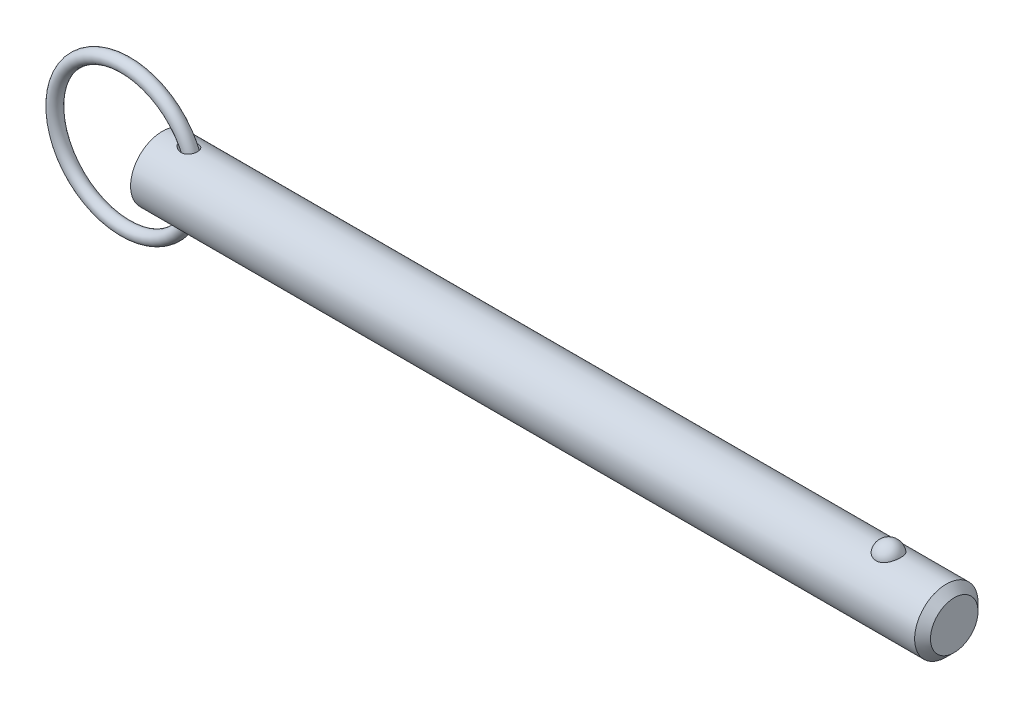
ISO-10303-21;
HEADER;
FILE_DESCRIPTION(('STEP AP214'),'2;1');
FILE_NAME('part.step','',(''),(''),'','','');
FILE_SCHEMA(('AUTOMOTIVE_DESIGN { 1 0 10303 214 1 1 1 1 }'));
ENDSEC;
DATA;
#1=APPLICATION_CONTEXT('core data for automotive mechanical design processes');
#2=APPLICATION_PROTOCOL_DEFINITION('international standard','automotive_design',2000,#1);
#3=PRODUCT_CONTEXT('',#1,'mechanical');
#4=PRODUCT('Part','Part','',(#3));
#5=PRODUCT_RELATED_PRODUCT_CATEGORY('part','',(#4));
#6=PRODUCT_DEFINITION_FORMATION('','',#4);
#7=PRODUCT_DEFINITION_CONTEXT('part definition',#1,'design');
#8=PRODUCT_DEFINITION('design','',#6,#7);
#9=PRODUCT_DEFINITION_SHAPE('','',#8);
#10=(LENGTH_UNIT() NAMED_UNIT(*) SI_UNIT(.MILLI.,.METRE.));
#11=(NAMED_UNIT(*) PLANE_ANGLE_UNIT() SI_UNIT($,.RADIAN.));
#12=(NAMED_UNIT(*) SI_UNIT($,.STERADIAN.) SOLID_ANGLE_UNIT());
#13=UNCERTAINTY_MEASURE_WITH_UNIT(LENGTH_MEASURE(1.E-05),#10,'distance_accuracy_value','');
#14=(GEOMETRIC_REPRESENTATION_CONTEXT(3) GLOBAL_UNCERTAINTY_ASSIGNED_CONTEXT((#13)) GLOBAL_UNIT_ASSIGNED_CONTEXT((#10,
#11,#12)) REPRESENTATION_CONTEXT('',''));
#15=CARTESIAN_POINT('',(0.,0.,0.));
#16=DIRECTION('',(0.,0.,1.));
#17=DIRECTION('',(1.,0.,0.));
#18=AXIS2_PLACEMENT_3D('',#15,#16,#17);
#19=CARTESIAN_POINT('',(-8.23730968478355,0.,0.));
#20=DIRECTION('',(0.,0.,1.));
#21=DIRECTION('',(1.,0.,0.));
#22=AXIS2_PLACEMENT_3D('',#19,#20,#21);
#23=TOROIDAL_SURFACE('',#22,15.875,1.422);
#24=CARTESIAN_POINT('',(9.05969031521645,0.,0.));
#25=VERTEX_POINT('',#24);
#26=VERTEX_LOOP('',#25);
#27=FACE_BOUND('',#26,.T.);
#28=ADVANCED_FACE('P0_F12',(#27),#23,.T.);
#29=CLOSED_SHELL('',(#28));
#30=MANIFOLD_SOLID_BREP('P0_B1',#29);
#31=CARTESIAN_POINT('',(0.,0.,0.));
#32=DIRECTION('',(1.,0.,0.));
#33=DIRECTION('',(0.,0.,-1.));
#34=AXIS2_PLACEMENT_3D('',#31,#32,#33);
#35=CYLINDRICAL_SURFACE('',#34,7.11);
#36=CARTESIAN_POINT('',(3.98467340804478,7.10072679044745,-0.363013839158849));
#37=CARTESIAN_POINT('',(4.00971652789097,7.09600153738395,-0.45539194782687));
#38=CARTESIAN_POINT('',(4.04401947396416,7.08958406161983,-0.545230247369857));
#39=CARTESIAN_POINT('',(4.12810160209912,7.07427055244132,-0.717157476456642));
#40=CARTESIAN_POINT('',(4.17791765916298,7.06536861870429,-0.799227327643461));
#41=CARTESIAN_POINT('',(4.28924471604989,7.04620300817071,-0.953469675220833));
#42=CARTESIAN_POINT('',(4.35063580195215,7.035953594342,-1.02573162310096));
#43=CARTESIAN_POINT('',(4.48282610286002,7.01493313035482,-1.16081412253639));
#44=CARTESIAN_POINT('',(4.55362244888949,7.00416223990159,-1.22363754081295));
#45=CARTESIAN_POINT('',(4.71659336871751,6.98090398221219,-1.35055080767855));
#46=CARTESIAN_POINT('',(4.81029272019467,6.96847103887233,-1.41269256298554));
#47=CARTESIAN_POINT('',(5.0057240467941,6.94515366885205,-1.52319699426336));
#48=CARTESIAN_POINT('',(5.10746392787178,6.93427079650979,-1.57154588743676));
#49=CARTESIAN_POINT('',(5.33503739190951,6.91346066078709,-1.66091325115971));
#50=CARTESIAN_POINT('',(5.46199550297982,6.90402388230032,-1.69921932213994));
#51=CARTESIAN_POINT('',(5.72084799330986,6.89024030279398,-1.75428261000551));
#52=CARTESIAN_POINT('',(5.85274301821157,6.88589416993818,-1.77103699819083));
#53=CARTESIAN_POINT('',(6.11557710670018,6.88337277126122,-1.78081990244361));
#54=CARTESIAN_POINT('',(6.24650031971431,6.88510489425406,-1.77420448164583));
#55=CARTESIAN_POINT('',(6.50446311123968,6.89478744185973,-1.73620392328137));
#56=CARTESIAN_POINT('',(6.6315075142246,6.90272978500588,-1.70485097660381));
#57=CARTESIAN_POINT('',(6.85933269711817,6.92243075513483,-1.62281888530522));
#58=CARTESIAN_POINT('',(6.96133251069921,6.93352131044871,-1.5753580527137));
#59=CARTESIAN_POINT('',(7.15436649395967,6.95824811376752,-1.46226310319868));
#60=CARTESIAN_POINT('',(7.24540699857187,6.97188287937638,-1.3966395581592));
#61=CARTESIAN_POINT('',(7.40446019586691,6.99838217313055,-1.25668991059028));
#62=CARTESIAN_POINT('',(7.473875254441,7.01118308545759,-1.18393777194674));
#63=CARTESIAN_POINT('',(7.59904891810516,7.03582803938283,-1.02736918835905));
#64=CARTESIAN_POINT('',(7.65481029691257,7.04767227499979,-0.943554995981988));
#65=CARTESIAN_POINT('',(7.74982438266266,7.06873077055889,-0.76979592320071));
#66=CARTESIAN_POINT('',(7.7894903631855,7.07800861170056,-0.680084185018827));
#67=CARTESIAN_POINT('',(7.85354088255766,7.09334756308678,-0.495102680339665));
#68=CARTESIAN_POINT('',(7.87792559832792,7.09940871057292,-0.399832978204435));
#69=CARTESIAN_POINT('',(7.9108898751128,7.10766731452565,-0.206294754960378));
#70=CARTESIAN_POINT('',(7.91944662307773,7.10985919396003,-0.108022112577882));
#71=CARTESIAN_POINT('',(7.920501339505,7.11012756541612,0.0886168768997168));
#72=CARTESIAN_POINT('',(7.91299895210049,7.10820396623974,0.186983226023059));
#73=CARTESIAN_POINT('',(7.88205794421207,7.10043733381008,0.381270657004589));
#74=CARTESIAN_POINT('',(7.85857985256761,7.09458459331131,0.477185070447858));
#75=CARTESIAN_POINT('',(7.79617406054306,7.07958431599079,0.663575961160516));
#76=CARTESIAN_POINT('',(7.75724672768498,7.07043685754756,0.754052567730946));
#77=CARTESIAN_POINT('',(7.66496731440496,7.04987259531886,0.926798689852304));
#78=CARTESIAN_POINT('',(7.61164530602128,7.0384605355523,1.00908483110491));
#79=CARTESIAN_POINT('',(7.49191707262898,7.01461776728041,1.16333092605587));
#80=CARTESIAN_POINT('',(7.42551210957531,7.00218715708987,1.235291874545));
#81=CARTESIAN_POINT('',(7.28164031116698,6.97770944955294,1.36680167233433));
#82=CARTESIAN_POINT('',(7.20420170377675,6.96566146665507,1.42638126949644));
#83=CARTESIAN_POINT('',(7.0403906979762,6.94319963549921,1.53199377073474));
#84=CARTESIAN_POINT('',(6.95401827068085,6.93278579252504,1.57802663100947));
#85=CARTESIAN_POINT('',(6.7731858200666,6.91444459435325,1.65656940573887));
#86=CARTESIAN_POINT('',(6.67860569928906,6.90656682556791,1.68881327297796));
#87=CARTESIAN_POINT('',(6.48544119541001,6.89422806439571,1.73849768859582));
#88=CARTESIAN_POINT('',(6.38685561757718,6.88976809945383,1.755933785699));
#89=CARTESIAN_POINT('',(6.18089829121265,6.88429907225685,1.77726234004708));
#90=CARTESIAN_POINT('',(6.07340937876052,6.88356485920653,1.78007646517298));
#91=CARTESIAN_POINT('',(5.85921220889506,6.886086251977,1.77029087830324));
#92=CARTESIAN_POINT('',(5.75250426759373,6.88934339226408,1.75768523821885));
#93=CARTESIAN_POINT('',(5.52848027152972,6.89994454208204,1.71563399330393));
#94=CARTESIAN_POINT('',(5.41155168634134,6.90775772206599,1.68424184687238));
#95=CARTESIAN_POINT('',(5.18376466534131,6.92670168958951,1.60454711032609));
#96=CARTESIAN_POINT('',(5.07291446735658,6.9378368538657,1.5562221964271));
#97=CARTESIAN_POINT('',(4.84835244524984,6.96347168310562,1.43744827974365));
#98=CARTESIAN_POINT('',(4.73562531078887,6.97820486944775,1.36517310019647));
#99=CARTESIAN_POINT('',(4.52504912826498,7.00822340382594,1.20158053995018));
#100=CARTESIAN_POINT('',(4.42717478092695,7.02350775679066,1.11029618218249));
#101=CARTESIAN_POINT('',(4.27935716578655,7.04784659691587,0.940654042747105));
#102=CARTESIAN_POINT('',(4.2239722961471,7.05736064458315,0.867099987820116));
#103=CARTESIAN_POINT('',(4.12558347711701,7.07469854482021,0.711919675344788));
#104=CARTESIAN_POINT('',(4.08256922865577,7.0825238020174,0.630300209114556));
#105=CARTESIAN_POINT('',(4.01142860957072,7.09565978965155,0.459428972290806));
#106=CARTESIAN_POINT('',(3.98346043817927,7.10094374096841,0.370107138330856));
#107=CARTESIAN_POINT('',(3.95517285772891,7.1063173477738,0.233358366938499));
#108=CARTESIAN_POINT('',(3.94802115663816,7.1076831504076,0.187321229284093));
#109=CARTESIAN_POINT('',(3.93842121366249,7.10951900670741,0.0947476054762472));
#110=CARTESIAN_POINT('',(3.93597129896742,7.10998937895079,0.0482113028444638));
#111=CARTESIAN_POINT('',(3.93584361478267,7.11001358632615,-0.0598597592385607));
#112=CARTESIAN_POINT('',(3.9399538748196,7.10922402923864,-0.121405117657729));
#113=CARTESIAN_POINT('',(3.95632793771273,7.10609781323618,-0.243320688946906));
#114=CARTESIAN_POINT('',(3.96859135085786,7.10376122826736,-0.303690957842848));
#115=CARTESIAN_POINT('',(3.98467340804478,7.10072679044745,-0.363013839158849));
#116=B_SPLINE_CURVE_WITH_KNOTS('',3,(#36,#37,#38,#39,#40,#41,#42,#43,#44,#45,#46,#47,#48,#49,
#50,#51,#52,#53,#54,#55,#56,#57,#58,#59,#60,#61,#62,#63,#64,#65,#66,#67,#68,#69,#70,#71,#72,#73,
#74,#75,#76,#77,#78,#79,#80,#81,#82,#83,#84,#85,#86,#87,#88,#89,#90,#91,#92,#93,#94,#95,#96,#97,
#98,#99,#100,#101,#102,#103,#104,#105,#106,#107,#108,#109,#110,#111,#112,#113,#114,#115),
.UNSPECIFIED.,.T.,.F.,(4,2,2,2,2,2,2,2,2,2,2,2,2,2,2,2,2,2,2,2,2,2,2,2,2,2,2,2,2,2,2,2,2,2,2,2,
2,2,2,4),(0.,0.287206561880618,0.575101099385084,0.860162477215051,1.14513709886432,
1.48324846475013,1.82169652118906,2.21865672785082,2.6156690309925,3.00665870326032,
3.39714041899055,3.73437585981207,4.07141541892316,4.37402271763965,4.67656849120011,
4.97076150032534,5.26495110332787,5.55956439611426,5.85418421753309,6.14953461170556,
6.44487798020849,6.73960905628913,7.03431171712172,7.32827352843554,7.6222362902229,
7.9216396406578,8.22113296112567,8.54242840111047,8.86384740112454,9.22635035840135,
9.58933304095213,9.99153142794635,10.3930368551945,10.6697219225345,10.9461759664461,
11.2254825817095,11.3650959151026,11.5046595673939,11.6891051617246,11.8735419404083),.UNSPECIFIED.);
#117=CARTESIAN_POINT('',(3.98467340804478,7.10072679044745,-0.363013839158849));
#118=VERTEX_POINT('',#117);
#119=EDGE_CURVE('P1_E40',#118,#118,#116,.T.);
#120=ORIENTED_EDGE('',*,*,#119,.T.);
#121=EDGE_LOOP('',(#120));
#122=FACE_BOUND('',#121,.T.);
#123=CARTESIAN_POINT('',(175.9925,0.,0.));
#124=DIRECTION('',(1.,0.,0.));
#125=DIRECTION('',(0.,0.,-1.));
#126=AXIS2_PLACEMENT_3D('',#123,#124,#125);
#127=CIRCLE('',#126,7.11);
#128=CARTESIAN_POINT('',(175.9925,0.,-7.11));
#129=VERTEX_POINT('',#128);
#130=EDGE_CURVE('P1_E25',#129,#129,#127,.T.);
#131=ORIENTED_EDGE('',*,*,#130,.F.);
#132=EDGE_LOOP('',(#131));
#133=FACE_BOUND('',#132,.T.);
#134=CARTESIAN_POINT('',(0.,0.,0.));
#135=DIRECTION('',(1.,0.,0.));
#136=DIRECTION('',(0.,0.,-1.));
#137=AXIS2_PLACEMENT_3D('',#134,#135,#136);
#138=CIRCLE('',#137,7.11);
#139=CARTESIAN_POINT('',(0.,0.,-7.11));
#140=VERTEX_POINT('',#139);
#141=EDGE_CURVE('P1_E9',#140,#140,#138,.T.);
#142=ORIENTED_EDGE('',*,*,#141,.T.);
#143=EDGE_LOOP('',(#142));
#144=FACE_BOUND('',#143,.T.);
#145=CARTESIAN_POINT('',(163.029258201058,6.53646663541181,2.79762469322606));
#146=CARTESIAN_POINT('',(162.884429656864,6.5364787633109,2.79761243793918));
#147=CARTESIAN_POINT('',(162.739368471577,6.54144531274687,2.78608115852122));
#148=CARTESIAN_POINT('',(162.453292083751,6.56077791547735,2.74023282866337));
#149=CARTESIAN_POINT('',(162.312288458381,6.57516852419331,2.70585624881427));
#150=CARTESIAN_POINT('',(162.03888335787,6.61165072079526,2.61544042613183));
#151=CARTESIAN_POINT('',(161.906460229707,6.63372195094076,2.55945840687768));
#152=CARTESIAN_POINT('',(161.653233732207,6.68316012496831,2.42742958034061));
#153=CARTESIAN_POINT('',(161.532425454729,6.71052481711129,2.3513912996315));
#154=CARTESIAN_POINT('',(161.301637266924,6.76860821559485,2.17866150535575));
#155=CARTESIAN_POINT('',(161.192085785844,6.79940242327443,2.08142342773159));
#156=CARTESIAN_POINT('',(160.99033404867,6.86050242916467,1.87020907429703));
#157=CARTESIAN_POINT('',(160.898139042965,6.89080807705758,1.75622775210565));
#158=CARTESIAN_POINT('',(160.72925478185,6.94923069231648,1.50900646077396));
#159=CARTESIAN_POINT('',(160.653428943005,6.97719213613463,1.37513873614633));
#160=CARTESIAN_POINT('',(160.524206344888,7.02647251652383,1.09584817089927));
#161=CARTESIAN_POINT('',(160.470810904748,7.04779106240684,0.950424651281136));
#162=CARTESIAN_POINT('',(160.387101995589,7.08180248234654,0.650508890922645));
#163=CARTESIAN_POINT('',(160.357025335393,7.09440672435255,0.495940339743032));
#164=CARTESIAN_POINT('',(160.321473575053,7.10935121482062,0.183515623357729));
#165=CARTESIAN_POINT('',(160.315997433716,7.11169189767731,0.0256595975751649));
#166=CARTESIAN_POINT('',(160.329700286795,7.10589702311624,-0.287512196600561));
#167=CARTESIAN_POINT('',(160.34868231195,7.0978451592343,-0.442838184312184));
#168=CARTESIAN_POINT('',(160.41057450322,7.07221860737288,-0.74783089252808));
#169=CARTESIAN_POINT('',(160.453485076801,7.05464375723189,-0.897497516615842));
#170=CARTESIAN_POINT('',(160.562452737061,7.01171031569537,-1.18722864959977));
#171=CARTESIAN_POINT('',(160.628545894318,6.98633960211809,-1.32727778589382));
#172=CARTESIAN_POINT('',(160.782536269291,6.93042258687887,-1.59370324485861));
#173=CARTESIAN_POINT('',(160.870435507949,6.89987580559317,-1.72007829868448));
#174=CARTESIAN_POINT('',(161.066926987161,6.83659510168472,-1.95657345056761));
#175=CARTESIAN_POINT('',(161.175664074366,6.80384697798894,-2.06656957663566));
#176=CARTESIAN_POINT('',(161.410968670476,6.74001831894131,-2.26611005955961));
#177=CARTESIAN_POINT('',(161.537535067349,6.70893767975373,-2.35565569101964));
#178=CARTESIAN_POINT('',(161.802845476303,6.6526444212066,-2.51019726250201));
#179=CARTESIAN_POINT('',(161.941323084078,6.62733449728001,-2.57561395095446));
#180=CARTESIAN_POINT('',(162.228519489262,6.5849599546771,-2.68211134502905));
#181=CARTESIAN_POINT('',(162.377234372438,6.56789220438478,-2.72320129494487));
#182=CARTESIAN_POINT('',(162.672626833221,6.54478663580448,-2.77825810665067));
#183=CARTESIAN_POINT('',(162.819029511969,6.53823639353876,-2.79348727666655));
#184=CARTESIAN_POINT('',(163.112470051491,6.53532718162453,-2.80028921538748));
#185=CARTESIAN_POINT('',(163.259507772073,6.53896606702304,-2.79186696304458));
#186=CARTESIAN_POINT('',(163.544921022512,6.55570357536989,-2.75232178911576));
#187=CARTESIAN_POINT('',(163.683422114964,6.56848455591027,-2.72196077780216));
#188=CARTESIAN_POINT('',(163.953114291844,6.60173528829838,-2.64028774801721));
#189=CARTESIAN_POINT('',(164.084304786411,6.62220565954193,-2.58897404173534));
#190=CARTESIAN_POINT('',(164.338846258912,6.66917927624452,-2.46547820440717));
#191=CARTESIAN_POINT('',(164.461969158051,6.69580233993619,-2.39287266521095));
#192=CARTESIAN_POINT('',(164.694441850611,6.75207041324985,-2.22915269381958));
#193=CARTESIAN_POINT('',(164.803788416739,6.78171612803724,-2.13803393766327));
#194=CARTESIAN_POINT('',(165.011642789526,6.84264629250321,-1.9344559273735));
#195=CARTESIAN_POINT('',(165.109317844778,6.87393748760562,-1.82114774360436));
#196=CARTESIAN_POINT('',(165.285011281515,6.93345710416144,-1.57947787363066));
#197=CARTESIAN_POINT('',(165.363026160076,6.96168497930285,-1.45111351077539));
#198=CARTESIAN_POINT('',(165.499985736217,7.01307558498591,-1.1784270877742));
#199=CARTESIAN_POINT('',(165.558258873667,7.03605262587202,-1.03373189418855));
#200=CARTESIAN_POINT('',(165.651081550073,7.07340932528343,-0.735867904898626));
#201=CARTESIAN_POINT('',(165.685631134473,7.08778900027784,-0.582699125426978));
#202=CARTESIAN_POINT('',(165.730274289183,7.10647639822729,-0.272420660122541));
#203=CARTESIAN_POINT('',(165.74039710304,7.11079616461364,-0.115315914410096));
#204=CARTESIAN_POINT('',(165.736061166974,7.10896059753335,0.198488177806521));
#205=CARTESIAN_POINT('',(165.721603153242,7.10280557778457,0.355187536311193));
#206=CARTESIAN_POINT('',(165.668572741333,7.08071500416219,0.662724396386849));
#207=CARTESIAN_POINT('',(165.63015058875,7.06484039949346,0.813592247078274));
#208=CARTESIAN_POINT('',(165.530101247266,7.02495896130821,1.10629159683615));
#209=CARTESIAN_POINT('',(165.468472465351,7.00095156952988,1.24812247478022));
#210=CARTESIAN_POINT('',(165.322766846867,6.94706632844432,1.51976439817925));
#211=CARTESIAN_POINT('',(165.238544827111,6.91715085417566,1.64949012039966));
#212=CARTESIAN_POINT('',(165.049586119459,6.8547056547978,1.89231285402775));
#213=CARTESIAN_POINT('',(164.944850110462,6.82217601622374,2.00541041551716));
#214=CARTESIAN_POINT('',(164.717103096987,6.75805358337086,2.21190674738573));
#215=CARTESIAN_POINT('',(164.594082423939,6.72646129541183,2.30529503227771));
#216=CARTESIAN_POINT('',(164.33273470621,6.66789520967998,2.46959908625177));
#217=CARTESIAN_POINT('',(164.194401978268,6.64092313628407,2.54050647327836));
#218=CARTESIAN_POINT('',(163.911182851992,6.59572583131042,2.65560045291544));
#219=CARTESIAN_POINT('',(163.766666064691,6.57724013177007,2.70059539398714));
#220=CARTESIAN_POINT('',(163.471546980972,6.55006426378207,2.76587321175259));
#221=CARTESIAN_POINT('',(163.320964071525,6.54134511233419,2.78622922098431));
#222=CARTESIAN_POINT('',(163.123046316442,6.53697847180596,2.79642434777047));
#223=CARTESIAN_POINT('',(163.076164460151,6.53646270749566,2.79762866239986));
#224=CARTESIAN_POINT('',(163.029258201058,6.53646663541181,2.79762469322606));
#225=B_SPLINE_CURVE_WITH_KNOTS('',3,(#145,#146,#147,#148,#149,#150,#151,#152,#153,#154,#155,
#156,#157,#158,#159,#160,#161,#162,#163,#164,#165,#166,#167,#168,#169,#170,#171,#172,#173,#174,
#175,#176,#177,#178,#179,#180,#181,#182,#183,#184,#185,#186,#187,#188,#189,#190,#191,#192,#193,
#194,#195,#196,#197,#198,#199,#200,#201,#202,#203,#204,#205,#206,#207,#208,#209,#210,#211,#212,
#213,#214,#215,#216,#217,#218,#219,#220,#221,#222,#223,#224),.UNSPECIFIED.,.T.,.F.,(4,2,2,2,2,2,
2,2,2,2,2,2,2,2,2,2,2,2,2,2,2,2,2,2,2,2,2,2,2,2,2,2,2,2,2,2,2,2,2,4),(0.,0.43435572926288,
0.869847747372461,1.30419416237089,1.73835621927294,2.18541922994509,2.6326172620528,
3.09954261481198,3.56649542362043,4.03813031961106,4.50974525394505,4.97758575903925,
5.44543423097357,5.91401389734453,6.3826370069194,6.85464418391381,7.32662193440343,
7.78992971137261,8.25306131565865,8.69285754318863,9.13256119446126,9.55768625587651,
9.98284556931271,10.4171106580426,10.8514772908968,11.3079089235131,11.7644218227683,
12.2351898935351,12.7059570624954,13.1761603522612,13.646349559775,14.1136200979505,
14.5809227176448,15.0513032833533,15.5216682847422,15.9922828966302,16.4630727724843,
16.9182457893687,17.3720644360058,17.5127411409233),.UNSPECIFIED.);
#226=CARTESIAN_POINT('',(163.029258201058,6.53646663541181,2.79762469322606));
#227=VERTEX_POINT('',#226);
#228=EDGE_CURVE('P1_E34',#227,#227,#225,.T.);
#229=ORIENTED_EDGE('',*,*,#228,.T.);
#230=EDGE_LOOP('',(#229));
#231=FACE_BOUND('',#230,.T.);
#232=CARTESIAN_POINT('',(3.98467340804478,-7.10072679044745,-0.363013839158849));
#233=CARTESIAN_POINT('',(3.96426456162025,-7.10457733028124,-0.287714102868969));
#234=CARTESIAN_POINT('',(3.95000501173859,-7.10730349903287,-0.210695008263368));
#235=CARTESIAN_POINT('',(3.93481801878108,-7.11020840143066,-0.0553038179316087));
#236=CARTESIAN_POINT('',(3.93388435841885,-7.11038832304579,0.0230676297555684));
#237=CARTESIAN_POINT('',(3.94541910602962,-7.10817995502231,0.178714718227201));
#238=CARTESIAN_POINT('',(3.95787987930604,-7.10579312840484,0.25599095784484));
#239=CARTESIAN_POINT('',(3.99523775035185,-7.09872642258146,0.407352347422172));
#240=CARTESIAN_POINT('',(4.02014065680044,-7.09404547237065,0.481435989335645));
#241=CARTESIAN_POINT('',(4.08119600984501,-7.08278363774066,0.625775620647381));
#242=CARTESIAN_POINT('',(4.11749458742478,-7.07617815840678,0.695967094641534));
#243=CARTESIAN_POINT('',(4.19940836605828,-7.06165305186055,0.830508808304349));
#244=CARTESIAN_POINT('',(4.24502952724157,-7.0537325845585,0.894855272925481));
#245=CARTESIAN_POINT('',(4.36790232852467,-7.03310314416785,1.04688574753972));
#246=CARTESIAN_POINT('',(4.44977459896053,-7.01993229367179,1.13078695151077));
#247=CARTESIAN_POINT('',(4.62610796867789,-6.99351259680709,1.28411726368));
#248=CARTESIAN_POINT('',(4.7205898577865,-6.98026365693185,1.35352197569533));
#249=CARTESIAN_POINT('',(4.92036507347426,-6.9549104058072,1.47831921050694));
#250=CARTESIAN_POINT('',(5.02579054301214,-6.94282458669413,1.53350332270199));
#251=CARTESIAN_POINT('',(5.24378330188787,-6.92129098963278,1.62793610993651));
#252=CARTESIAN_POINT('',(5.35635066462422,-6.91184323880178,1.66718462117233));
#253=CARTESIAN_POINT('',(5.60134354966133,-6.89573491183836,1.73269893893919));
#254=CARTESIAN_POINT('',(5.73444697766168,-6.8895970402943,1.75661057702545));
#255=CARTESIAN_POINT('',(6.00300738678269,-6.88344616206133,1.78057487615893));
#256=CARTESIAN_POINT('',(6.13846360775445,-6.88343121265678,1.78063510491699));
#257=CARTESIAN_POINT('',(6.39660470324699,-6.88981379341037,1.75576480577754));
#258=CARTESIAN_POINT('',(6.51947843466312,-6.89572457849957,1.73273121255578));
#259=CARTESIAN_POINT('',(6.75813770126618,-6.91274434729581,1.66352936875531));
#260=CARTESIAN_POINT('',(6.87393155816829,-6.92384709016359,1.61738888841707));
#261=CARTESIAN_POINT('',(7.07801861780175,-6.94787316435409,1.51052664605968));
#262=CARTESIAN_POINT('',(7.16789841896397,-6.96033024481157,1.45271574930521));
#263=CARTESIAN_POINT('',(7.33546773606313,-6.98638661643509,1.32171912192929));
#264=CARTESIAN_POINT('',(7.41316182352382,-6.99998547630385,1.24853918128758));
#265=CARTESIAN_POINT('',(7.54861420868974,-7.02559503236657,1.09486170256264));
#266=CARTESIAN_POINT('',(7.60741145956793,-7.03764930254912,1.01528346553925));
#267=CARTESIAN_POINT('',(7.71070740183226,-7.0598657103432,0.847099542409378));
#268=CARTESIAN_POINT('',(7.75520788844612,-7.0700280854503,0.758494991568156));
#269=CARTESIAN_POINT('',(7.82836147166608,-7.08722075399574,0.575936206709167));
#270=CARTESIAN_POINT('',(7.85719783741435,-7.09428707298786,0.482058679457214));
#271=CARTESIAN_POINT('',(7.89918378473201,-7.10470260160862,0.29065874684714));
#272=CARTESIAN_POINT('',(7.91233308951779,-7.10805174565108,0.193136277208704));
#273=CARTESIAN_POINT('',(7.92267451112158,-7.11067890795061,-0.00313968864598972));
#274=CARTESIAN_POINT('',(7.91981203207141,-7.10994299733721,-0.10189624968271));
#275=CARTESIAN_POINT('',(7.89806489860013,-7.10444651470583,-0.297516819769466));
#276=CARTESIAN_POINT('',(7.87918005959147,-7.09968589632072,-0.394380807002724));
#277=CARTESIAN_POINT('',(7.82577988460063,-7.0866471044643,-0.58355375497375));
#278=CARTESIAN_POINT('',(7.79124976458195,-7.07836560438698,-0.675858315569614));
#279=CARTESIAN_POINT('',(7.70736343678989,-7.05919003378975,-0.853167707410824));
#280=CARTESIAN_POINT('',(7.65800801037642,-7.04829610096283,-0.938172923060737));
#281=CARTESIAN_POINT('',(7.54590141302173,-7.02513961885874,-1.09819812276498));
#282=CARTESIAN_POINT('',(7.48319521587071,-7.01288172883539,-1.17325029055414));
#283=CARTESIAN_POINT('',(7.34599775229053,-6.98832192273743,-1.31164333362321));
#284=CARTESIAN_POINT('',(7.27150757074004,-6.97602001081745,-1.37498528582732));
#285=CARTESIAN_POINT('',(7.11277776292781,-6.95268608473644,-1.48849974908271));
#286=CARTESIAN_POINT('',(7.02852525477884,-6.94165578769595,-1.53865456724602));
#287=CARTESIAN_POINT('',(6.85282430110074,-6.92200320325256,-1.62478650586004));
#288=CARTESIAN_POINT('',(6.76137511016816,-6.91338116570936,-1.66076215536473));
#289=CARTESIAN_POINT('',(6.57061179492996,-6.89906044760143,-1.71930563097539));
#290=CARTESIAN_POINT('',(6.47113516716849,-6.89347290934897,-1.74136795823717));
#291=CARTESIAN_POINT('',(6.26989833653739,-6.88605020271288,-1.7704895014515));
#292=CARTESIAN_POINT('',(6.16813737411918,-6.88421630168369,-1.77754365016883));
#293=CARTESIAN_POINT('',(5.95492537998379,-6.88424071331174,-1.77745174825));
#294=CARTESIAN_POINT('',(5.8434768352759,-6.88646827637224,-1.76888555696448));
#295=CARTESIAN_POINT('',(5.62307560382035,-6.89483827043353,-1.73596677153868));
#296=CARTESIAN_POINT('',(5.51412477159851,-6.90098351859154,-1.71160281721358));
#297=CARTESIAN_POINT('',(5.28644478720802,-6.91743803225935,-1.64393691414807));
#298=CARTESIAN_POINT('',(5.16837217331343,-6.92819628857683,-1.59852806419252));
#299=CARTESIAN_POINT('',(4.94091825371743,-6.95234836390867,-1.4899796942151));
#300=CARTESIAN_POINT('',(4.83153887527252,-6.96574276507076,-1.42683625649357));
#301=CARTESIAN_POINT('',(4.63576710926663,-6.99209234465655,-1.29112257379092));
#302=CARTESIAN_POINT('',(4.54816728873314,-7.00494184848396,-1.22027748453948));
#303=CARTESIAN_POINT('',(4.38554897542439,-7.03019055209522,-1.0652111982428));
#304=CARTESIAN_POINT('',(4.31052141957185,-7.04259007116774,-0.980999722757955));
#305=CARTESIAN_POINT('',(4.18551811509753,-7.0640229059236,-0.811206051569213));
#306=CARTESIAN_POINT('',(4.13358417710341,-7.07328321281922,-0.727107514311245));
#307=CARTESIAN_POINT('',(4.04607461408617,-7.0891994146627,-0.550580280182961));
#308=CARTESIAN_POINT('',(4.01046401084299,-7.09586087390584,-0.458169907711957));
#309=CARTESIAN_POINT('',(3.98467340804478,-7.10072679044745,-0.363013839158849));
#310=B_SPLINE_CURVE_WITH_KNOTS('',3,(#232,#233,#234,#235,#236,#237,#238,#239,#240,#241,#242,
#243,#244,#245,#246,#247,#248,#249,#250,#251,#252,#253,#254,#255,#256,#257,#258,#259,#260,#261,
#262,#263,#264,#265,#266,#267,#268,#269,#270,#271,#272,#273,#274,#275,#276,#277,#278,#279,#280,
#281,#282,#283,#284,#285,#286,#287,#288,#289,#290,#291,#292,#293,#294,#295,#296,#297,#298,#299,
#300,#301,#302,#303,#304,#305,#306,#307,#308,#309),.UNSPECIFIED.,.T.,.F.,(4,2,2,2,2,2,2,2,2,2,2,
2,2,2,2,2,2,2,2,2,2,2,2,2,2,2,2,2,2,2,2,2,2,2,2,2,2,2,4),(0.,0.23402065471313,0.467932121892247,
0.701710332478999,0.935597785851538,1.17261620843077,1.40978663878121,1.76177576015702,
2.11435255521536,2.47183528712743,2.8293216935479,3.23332937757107,3.63720887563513,
4.01042610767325,4.38319587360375,4.70425151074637,5.02518641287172,5.32277979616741,
5.62033579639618,5.91433101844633,6.2083314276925,6.50333490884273,6.79834178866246,
7.09362801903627,7.38889868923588,7.6831900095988,7.9774542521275,8.27211131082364,
8.56679892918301,8.8716552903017,9.17661456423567,9.51069129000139,9.84500851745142,
10.2243046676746,10.6036846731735,10.9425776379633,11.2812252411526,11.5775945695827,
11.8733258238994),.UNSPECIFIED.);
#311=CARTESIAN_POINT('',(3.98467340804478,-7.10072679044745,-0.363013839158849));
#312=VERTEX_POINT('',#311);
#313=EDGE_CURVE('P1_E17',#312,#312,#310,.T.);
#314=ORIENTED_EDGE('',*,*,#313,.T.);
#315=EDGE_LOOP('',(#314));
#316=FACE_BOUND('',#315,.T.);
#317=ADVANCED_FACE('P1_F13',(#122,#133,#144,#231,#316),#35,.T.);
#318=CARTESIAN_POINT('',(0.,0.,0.));
#319=DIRECTION('',(-1.,0.,0.));
#320=DIRECTION('',(0.,0.,1.));
#321=AXIS2_PLACEMENT_3D('',#318,#319,#320);
#322=PLANE('',#321);
#323=ORIENTED_EDGE('',*,*,#141,.F.);
#324=EDGE_LOOP('',(#323));
#325=FACE_BOUND('',#324,.T.);
#326=ADVANCED_FACE('P1_F15',(#325),#322,.T.);
#327=CARTESIAN_POINT('',(177.77,0.,0.));
#328=DIRECTION('',(-1.,0.,0.));
#329=DIRECTION('',(0.,0.,1.));
#330=AXIS2_PLACEMENT_3D('',#327,#328,#329);
#331=CONICAL_SURFACE('',#330,5.33250000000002,0.785398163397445);
#332=ORIENTED_EDGE('',*,*,#130,.T.);
#333=EDGE_LOOP('',(#332));
#334=FACE_BOUND('',#333,.T.);
#335=CARTESIAN_POINT('',(177.77,0.,0.));
#336=DIRECTION('',(1.,0.,0.));
#337=DIRECTION('',(0.,0.,-1.));
#338=AXIS2_PLACEMENT_3D('',#335,#336,#337);
#339=CIRCLE('',#338,5.33250000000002);
#340=CARTESIAN_POINT('',(177.77,0.,-5.33250000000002));
#341=VERTEX_POINT('',#340);
#342=EDGE_CURVE('P1_E30',#341,#341,#339,.T.);
#343=ORIENTED_EDGE('',*,*,#342,.F.);
#344=EDGE_LOOP('',(#343));
#345=FACE_BOUND('',#344,.T.);
#346=ADVANCED_FACE('P1_F55',(#334,#345),#331,.T.);
#347=CARTESIAN_POINT('',(177.77,5.33250000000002,0.));
#348=DIRECTION('',(1.,0.,0.));
#349=DIRECTION('',(0.,0.,-1.));
#350=AXIS2_PLACEMENT_3D('',#347,#348,#349);
#351=PLANE('',#350);
#352=ORIENTED_EDGE('',*,*,#342,.T.);
#353=EDGE_LOOP('',(#352));
#354=FACE_BOUND('',#353,.T.);
#355=ADVANCED_FACE('P1_F51',(#354),#351,.T.);
#356=CARTESIAN_POINT('',(163.029258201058,6.399,0.));
#357=DIRECTION('',(-1.,0.,0.));
#358=DIRECTION('',(0.,1.,0.));
#359=AXIS2_PLACEMENT_3D('',#356,#357,#358);
#360=SPHERICAL_SURFACE('',#359,2.80099999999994);
#361=ORIENTED_EDGE('',*,*,#228,.F.);
#362=EDGE_LOOP('',(#361));
#363=FACE_BOUND('',#362,.T.);
#364=ADVANCED_FACE('P1_F46',(#363),#360,.T.);
#365=CARTESIAN_POINT('',(-8.23730968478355,0.,0.));
#366=DIRECTION('',(0.,0.,1.));
#367=DIRECTION('',(1.,0.,0.));
#368=AXIS2_PLACEMENT_3D('',#365,#366,#367);
#369=TOROIDAL_SURFACE('',#368,15.875,1.7775);
#370=ORIENTED_EDGE('',*,*,#313,.F.);
#371=EDGE_LOOP('',(#370));
#372=FACE_BOUND('',#371,.T.);
#373=ORIENTED_EDGE('',*,*,#119,.F.);
#374=EDGE_LOOP('',(#373));
#375=FACE_BOUND('',#374,.T.);
#376=ADVANCED_FACE('P1_F50',(#372,#375),#369,.F.);
#377=CLOSED_SHELL('',(#317,#326,#346,#355,#364,#376));
#378=MANIFOLD_SOLID_BREP('P1_B1',#377);
#379=ADVANCED_BREP_SHAPE_REPRESENTATION('',(#18,#30,#378),#14);
#380=SHAPE_DEFINITION_REPRESENTATION(#9,#379);
ENDSEC;
END-ISO-10303-21;
